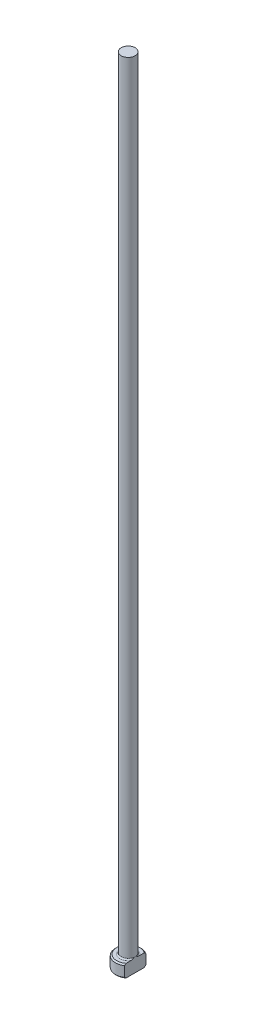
ISO-10303-21;
HEADER;
FILE_DESCRIPTION(('STEP AP214'),'2;1');
FILE_NAME('part.step','',(''),(''),'','','');
FILE_SCHEMA(('AUTOMOTIVE_DESIGN { 1 0 10303 214 1 1 1 1 }'));
ENDSEC;
DATA;
#1=APPLICATION_CONTEXT('core data for automotive mechanical design processes');
#2=APPLICATION_PROTOCOL_DEFINITION('international standard','automotive_design',2000,#1);
#3=PRODUCT_CONTEXT('',#1,'mechanical');
#4=PRODUCT('Part','Part','',(#3));
#5=PRODUCT_RELATED_PRODUCT_CATEGORY('part','',(#4));
#6=PRODUCT_DEFINITION_FORMATION('','',#4);
#7=PRODUCT_DEFINITION_CONTEXT('part definition',#1,'design');
#8=PRODUCT_DEFINITION('design','',#6,#7);
#9=PRODUCT_DEFINITION_SHAPE('','',#8);
#10=(LENGTH_UNIT() NAMED_UNIT(*) SI_UNIT(.MILLI.,.METRE.));
#11=(NAMED_UNIT(*) PLANE_ANGLE_UNIT() SI_UNIT($,.RADIAN.));
#12=(NAMED_UNIT(*) SI_UNIT($,.STERADIAN.) SOLID_ANGLE_UNIT());
#13=UNCERTAINTY_MEASURE_WITH_UNIT(LENGTH_MEASURE(1.E-05),#10,'distance_accuracy_value','');
#14=(GEOMETRIC_REPRESENTATION_CONTEXT(3) GLOBAL_UNCERTAINTY_ASSIGNED_CONTEXT((#13)) GLOBAL_UNIT_ASSIGNED_CONTEXT((#10,
#11,#12)) REPRESENTATION_CONTEXT('',''));
#15=CARTESIAN_POINT('',(0.,0.,0.));
#16=DIRECTION('',(0.,0.,1.));
#17=DIRECTION('',(1.,0.,0.));
#18=AXIS2_PLACEMENT_3D('',#15,#16,#17);
#19=CARTESIAN_POINT('',(0.,0.,0.));
#20=DIRECTION('',(0.,-1.,0.));
#21=DIRECTION('',(0.,0.,-1.));
#22=AXIS2_PLACEMENT_3D('',#19,#20,#21);
#23=PLANE('',#22);
#24=CARTESIAN_POINT('',(0.,0.,0.));
#25=DIRECTION('',(0.,-1.,0.));
#26=DIRECTION('',(0.,0.,-1.));
#27=AXIS2_PLACEMENT_3D('',#24,#25,#26);
#28=CIRCLE('',#27,1.8);
#29=CARTESIAN_POINT('',(1.09999999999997,0.,1.42478068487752));
#30=VERTEX_POINT('',#29);
#31=CARTESIAN_POINT('',(1.09999999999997,0.,-1.42478068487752));
#32=VERTEX_POINT('',#31);
#33=EDGE_CURVE('E98',#30,#32,#28,.T.);
#34=ORIENTED_EDGE('',*,*,#33,.T.);
#35=DIRECTION('',(0.,0.,1.));
#36=VECTOR('',#35,1.);
#37=CARTESIAN_POINT('',(1.09999999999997,0.,-1.67032930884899));
#38=LINE('',#37,#36);
#39=EDGE_CURVE('E83',#32,#30,#38,.T.);
#40=ORIENTED_EDGE('',*,*,#39,.T.);
#41=EDGE_LOOP('',(#34,#40));
#42=FACE_BOUND('',#41,.T.);
#43=ADVANCED_FACE('F32',(#42),#23,.T.);
#44=CARTESIAN_POINT('',(0.,259.958771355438,0.));
#45=DIRECTION('',(0.,1.,0.));
#46=DIRECTION('',(0.,0.,1.));
#47=AXIS2_PLACEMENT_3D('',#44,#45,#46);
#48=CYLINDRICAL_SURFACE('',#47,1.99999999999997);
#49=CARTESIAN_POINT('',(0.,1.79999999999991,0.));
#50=DIRECTION('',(0.,1.,0.));
#51=DIRECTION('',(0.,0.,1.));
#52=AXIS2_PLACEMENT_3D('',#49,#50,#51);
#53=CIRCLE('',#52,1.99999999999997);
#54=CARTESIAN_POINT('',(1.09999999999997,1.79999999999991,1.67032930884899));
#55=VERTEX_POINT('',#54);
#56=CARTESIAN_POINT('',(1.09999999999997,1.79999999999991,-1.67032930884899));
#57=VERTEX_POINT('',#56);
#58=EDGE_CURVE('E104',#55,#57,#53,.F.);
#59=ORIENTED_EDGE('',*,*,#58,.T.);
#60=DIRECTION('',(0.,-1.,0.));
#61=VECTOR('',#60,1.);
#62=CARTESIAN_POINT('',(1.09999999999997,125.,-1.67032930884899));
#63=LINE('',#62,#61);
#64=CARTESIAN_POINT('',(1.09999999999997,0.199999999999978,-1.67032930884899));
#65=VERTEX_POINT('',#64);
#66=EDGE_CURVE('E183',#57,#65,#63,.T.);
#67=ORIENTED_EDGE('',*,*,#66,.T.);
#68=CARTESIAN_POINT('',(0.,0.199999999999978,0.));
#69=DIRECTION('',(0.,-1.,0.));
#70=DIRECTION('',(0.,0.,-1.));
#71=AXIS2_PLACEMENT_3D('',#68,#69,#70);
#72=CIRCLE('',#71,1.99999999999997);
#73=CARTESIAN_POINT('',(1.09999999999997,0.199999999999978,1.67032930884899));
#74=VERTEX_POINT('',#73);
#75=EDGE_CURVE('E100',#65,#74,#72,.F.);
#76=ORIENTED_EDGE('',*,*,#75,.T.);
#77=DIRECTION('',(0.,-1.,0.));
#78=VECTOR('',#77,1.);
#79=CARTESIAN_POINT('',(1.09999999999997,125.,1.67032930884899));
#80=LINE('',#79,#78);
#81=EDGE_CURVE('E93',#55,#74,#80,.T.);
#82=ORIENTED_EDGE('',*,*,#81,.F.);
#83=EDGE_LOOP('',(#59,#67,#76,#82));
#84=FACE_BOUND('',#83,.T.);
#85=ADVANCED_FACE('F158',(#84),#48,.T.);
#86=CARTESIAN_POINT('',(-1.99999999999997,2.,0.));
#87=DIRECTION('',(0.,1.,0.));
#88=DIRECTION('',(0.,0.,1.));
#89=AXIS2_PLACEMENT_3D('',#86,#87,#88);
#90=PLANE('',#89);
#91=CARTESIAN_POINT('',(0.,2.,0.));
#92=DIRECTION('',(0.,1.,0.));
#93=DIRECTION('',(0.,0.,1.));
#94=AXIS2_PLACEMENT_3D('',#91,#92,#93);
#95=CIRCLE('',#94,1.79999999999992);
#96=CARTESIAN_POINT('',(1.09999999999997,2.,-1.42478068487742));
#97=VERTEX_POINT('',#96);
#98=CARTESIAN_POINT('',(1.09999999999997,2.,1.42478068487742));
#99=VERTEX_POINT('',#98);
#100=EDGE_CURVE('E178',#97,#99,#95,.T.);
#101=ORIENTED_EDGE('',*,*,#100,.T.);
#102=DIRECTION('',(0.,0.,-1.));
#103=VECTOR('',#102,1.);
#104=CARTESIAN_POINT('',(1.09999999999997,2.,0.));
#105=LINE('',#104,#103);
#106=CARTESIAN_POINT('',(1.09999999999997,1.99999999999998,0.692820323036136));
#107=VERTEX_POINT('',#106);
#108=EDGE_CURVE('E57',#99,#107,#105,.T.);
#109=ORIENTED_EDGE('',*,*,#108,.T.);
#110=CARTESIAN_POINT('',(0.,2.,0.));
#111=DIRECTION('',(0.,1.,0.));
#112=DIRECTION('',(0.,0.,1.));
#113=AXIS2_PLACEMENT_3D('',#110,#111,#112);
#114=CIRCLE('',#113,1.29999999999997);
#115=CARTESIAN_POINT('',(1.09999999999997,1.99999999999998,-0.692820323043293));
#116=VERTEX_POINT('',#115);
#117=EDGE_CURVE('E107',#107,#116,#114,.F.);
#118=ORIENTED_EDGE('',*,*,#117,.T.);
#119=EDGE_CURVE('E136',#116,#97,#105,.T.);
#120=ORIENTED_EDGE('',*,*,#119,.T.);
#121=EDGE_LOOP('',(#101,#109,#118,#120));
#122=FACE_BOUND('',#121,.T.);
#123=ADVANCED_FACE('F147',(#122),#90,.T.);
#124=CARTESIAN_POINT('',(0.,2.,0.));
#125=DIRECTION('',(0.,-1.,0.));
#126=DIRECTION('',(0.,0.,-1.));
#127=AXIS2_PLACEMENT_3D('',#124,#125,#126);
#128=CONICAL_SURFACE('',#127,1.79999999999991,0.785398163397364);
#129=ORIENTED_EDGE('',*,*,#58,.F.);
#130=CARTESIAN_POINT('',(1.09999999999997,-0.0394609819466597,3.67851337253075));
#131=CARTESIAN_POINT('',(1.09999999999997,0.0938871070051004,3.53927086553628));
#132=CARTESIAN_POINT('',(1.09999999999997,0.226969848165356,3.39976850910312));
#133=CARTESIAN_POINT('',(1.09999999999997,0.492235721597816,3.11984283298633));
#134=CARTESIAN_POINT('',(1.09999999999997,0.62441861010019,2.97941928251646));
#135=CARTESIAN_POINT('',(1.09999999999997,0.887405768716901,2.69736523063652));
#136=CARTESIAN_POINT('',(1.09999999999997,1.01821044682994,2.55573511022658));
#137=CARTESIAN_POINT('',(1.09999999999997,1.27771059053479,2.27057337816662));
#138=CARTESIAN_POINT('',(1.09999999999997,1.40640632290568,2.12704201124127));
#139=CARTESIAN_POINT('',(1.09999999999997,1.59274008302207,1.91391242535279));
#140=CARTESIAN_POINT('',(1.09999999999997,1.65179690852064,1.84555665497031));
#141=CARTESIAN_POINT('',(1.09999999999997,1.76883123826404,1.70791335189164));
#142=CARTESIAN_POINT('',(1.09999999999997,1.82680864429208,1.63862573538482));
#143=CARTESIAN_POINT('',(1.09999999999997,1.94139081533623,1.49868129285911));
#144=CARTESIAN_POINT('',(1.09999999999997,1.99799249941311,1.42802193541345));
#145=CARTESIAN_POINT('',(1.09999999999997,2.10905321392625,1.28504453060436));
#146=CARTESIAN_POINT('',(1.09999999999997,2.16351265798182,1.21272680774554));
#147=CARTESIAN_POINT('',(1.09999999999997,2.25351962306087,1.08760351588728));
#148=CARTESIAN_POINT('',(1.09999999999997,2.28987864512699,1.03538457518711));
#149=CARTESIAN_POINT('',(1.09999999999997,2.3604146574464,0.929499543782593));
#150=CARTESIAN_POINT('',(1.09999999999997,2.39459216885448,0.875833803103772));
#151=CARTESIAN_POINT('',(1.09999999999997,2.45984644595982,0.76675784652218));
#152=CARTESIAN_POINT('',(1.09999999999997,2.49092891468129,0.711351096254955));
#153=CARTESIAN_POINT('',(1.09999999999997,2.54873716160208,0.598347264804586));
#154=CARTESIAN_POINT('',(1.09999999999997,2.57546692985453,0.54075224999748));
#155=CARTESIAN_POINT('',(1.09999999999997,2.62531671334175,0.416467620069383));
#156=CARTESIAN_POINT('',(1.09999999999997,2.64771917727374,0.349473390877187));
#157=CARTESIAN_POINT('',(1.09999999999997,2.67308404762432,0.247046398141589));
#158=CARTESIAN_POINT('',(1.09999999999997,2.68016204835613,0.212626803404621));
#159=CARTESIAN_POINT('',(1.09999999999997,2.69123178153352,0.143302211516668));
#160=CARTESIAN_POINT('',(1.09999999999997,2.69522514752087,0.108397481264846));
#161=CARTESIAN_POINT('',(1.09999999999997,2.69990666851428,0.0380394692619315));
#162=CARTESIAN_POINT('',(1.09999999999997,2.70056409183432,0.00258409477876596));
#163=CARTESIAN_POINT('',(1.09999999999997,2.69845711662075,-0.0682167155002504));
#164=CARTESIAN_POINT('',(1.09999999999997,2.69569269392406,-0.103562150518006));
#165=CARTESIAN_POINT('',(1.09999999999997,2.68246916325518,-0.209100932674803));
#166=CARTESIAN_POINT('',(1.09999999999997,2.66707429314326,-0.278705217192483));
#167=CARTESIAN_POINT('',(1.09999999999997,2.63112909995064,-0.398409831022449));
#168=CARTESIAN_POINT('',(1.09999999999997,2.61268926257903,-0.449196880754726));
#169=CARTESIAN_POINT('',(1.09999999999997,2.57144771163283,-0.54899856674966));
#170=CARTESIAN_POINT('',(1.09999999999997,2.54864260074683,-0.598011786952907));
#171=CARTESIAN_POINT('',(1.09999999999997,2.499708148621,-0.694626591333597));
#172=CARTESIAN_POINT('',(1.09999999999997,2.47356275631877,-0.742219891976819));
#173=CARTESIAN_POINT('',(1.09999999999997,2.41890398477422,-0.83598679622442));
#174=CARTESIAN_POINT('',(1.09999999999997,2.39039158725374,-0.882160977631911));
#175=CARTESIAN_POINT('',(1.09999999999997,2.32625511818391,-0.981643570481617));
#176=CARTESIAN_POINT('',(1.09999999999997,2.29028006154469,-1.03472421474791));
#177=CARTESIAN_POINT('',(1.09999999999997,2.21653305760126,-1.1396274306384));
#178=CARTESIAN_POINT('',(1.09999999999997,2.17876074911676,-1.1914497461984));
#179=CARTESIAN_POINT('',(1.09999999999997,2.06341857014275,-1.34551007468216));
#180=CARTESIAN_POINT('',(1.09999999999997,1.98387469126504,-1.44626517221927));
#181=CARTESIAN_POINT('',(1.09999999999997,1.82152847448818,-1.64549240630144));
#182=CARTESIAN_POINT('',(1.09999999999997,1.7387185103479,-1.74395822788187));
#183=CARTESIAN_POINT('',(1.09999999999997,1.57115072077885,-1.93914128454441));
#184=CARTESIAN_POINT('',(1.09999999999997,1.48639373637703,-2.0358592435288));
#185=CARTESIAN_POINT('',(1.09999999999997,1.3154590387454,-2.22820182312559));
#186=CARTESIAN_POINT('',(1.09999999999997,1.2292799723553,-2.32382523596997));
#187=CARTESIAN_POINT('',(1.09999999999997,1.0559632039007,-2.51421569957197));
#188=CARTESIAN_POINT('',(1.09999999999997,0.968825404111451,-2.60898266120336));
#189=CARTESIAN_POINT('',(1.09999999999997,0.706597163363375,-2.89210208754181));
#190=CARTESIAN_POINT('',(1.09999999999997,0.530482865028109,-3.07950542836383));
#191=CARTESIAN_POINT('',(1.09999999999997,0.288219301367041,-3.33512571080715));
#192=CARTESIAN_POINT('',(1.09999999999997,0.222748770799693,-3.40399021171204));
#193=CARTESIAN_POINT('',(1.09999999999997,0.091724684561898,-3.54143252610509));
#194=CARTESIAN_POINT('',(1.09999999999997,0.0261714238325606,-3.61001062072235));
#195=CARTESIAN_POINT('',(1.09999999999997,-0.0394609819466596,-3.67851337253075));
#196=B_SPLINE_CURVE_WITH_KNOTS('',3,(#130,#131,#132,#133,#134,#135,#136,#137,#138,#139,#140,
#141,#142,#143,#144,#145,#146,#147,#148,#149,#150,#151,#152,#153,#154,#155,#156,#157,#158,#159,
#160,#161,#162,#163,#164,#165,#166,#167,#168,#169,#170,#171,#172,#173,#174,#175,#176,#177,#178,
#179,#180,#181,#182,#183,#184,#185,#186,#187,#188,#189,#190,#191,#192,#193,#194,#195),
.UNSPECIFIED.,.F.,.F.,(4,2,2,2,2,2,2,2,2,2,2,2,2,2,2,2,2,2,2,2,2,2,2,2,2,2,2,2,2,2,2,2,4),(0.,
0.578393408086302,1.1569377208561,1.73530565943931,2.31359986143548,2.5845938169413,
2.8556123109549,3.12719032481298,3.39871564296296,3.58956709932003,3.78037278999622,
3.97082012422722,4.16109188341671,4.37223430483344,4.47753596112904,4.58278181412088,
4.68899548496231,4.79520990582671,5.00790932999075,5.16979123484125,5.33179964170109,
5.49461809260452,5.65736934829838,5.84968611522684,6.0420416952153,6.42702818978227,
6.81297408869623,7.19875629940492,7.58492959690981,7.9711426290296,8.7426312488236,
9.02768991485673,9.31229787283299),.UNSPECIFIED.);
#197=EDGE_CURVE('E135',#55,#99,#196,.T.);
#198=ORIENTED_EDGE('',*,*,#197,.T.);
#199=ORIENTED_EDGE('',*,*,#100,.F.);
#200=EDGE_CURVE('E127',#97,#57,#196,.T.);
#201=ORIENTED_EDGE('',*,*,#200,.T.);
#202=EDGE_LOOP('',(#129,#198,#199,#201));
#203=FACE_BOUND('',#202,.T.);
#204=ADVANCED_FACE('F143',(#203),#128,.T.);
#205=CARTESIAN_POINT('',(0.,0.199999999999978,0.));
#206=DIRECTION('',(0.,1.,0.));
#207=DIRECTION('',(0.,0.,1.));
#208=AXIS2_PLACEMENT_3D('',#205,#206,#207);
#209=CONICAL_SURFACE('',#208,1.99999999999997,0.785398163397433);
#210=ORIENTED_EDGE('',*,*,#75,.F.);
#211=CARTESIAN_POINT('',(1.09999999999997,2.03946098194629,-3.67851337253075));
#212=CARTESIAN_POINT('',(1.09999999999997,1.90611289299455,-3.53927086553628));
#213=CARTESIAN_POINT('',(1.09999999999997,1.77303015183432,-3.39976850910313));
#214=CARTESIAN_POINT('',(1.09999999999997,1.50776427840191,-3.11984283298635));
#215=CARTESIAN_POINT('',(1.09999999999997,1.37558138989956,-2.97941928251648));
#216=CARTESIAN_POINT('',(1.09999999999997,1.11259423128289,-2.69736523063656));
#217=CARTESIAN_POINT('',(1.09999999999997,0.981789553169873,-2.55573511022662));
#218=CARTESIAN_POINT('',(1.09999999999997,0.722289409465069,-2.27057337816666));
#219=CARTESIAN_POINT('',(1.09999999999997,0.593593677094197,-2.12704201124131));
#220=CARTESIAN_POINT('',(1.09999999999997,0.407259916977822,-1.91391242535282));
#221=CARTESIAN_POINT('',(1.09999999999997,0.348203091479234,-1.84555665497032));
#222=CARTESIAN_POINT('',(1.09999999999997,0.231168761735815,-1.7079133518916));
#223=CARTESIAN_POINT('',(1.09999999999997,0.173191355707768,-1.63862573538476));
#224=CARTESIAN_POINT('',(1.09999999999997,0.0586091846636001,-1.49868129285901));
#225=CARTESIAN_POINT('',(1.09999999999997,0.00200750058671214,-1.42802193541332));
#226=CARTESIAN_POINT('',(1.09999999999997,-0.109053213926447,-1.28504453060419));
#227=CARTESIAN_POINT('',(1.09999999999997,-0.16351265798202,-1.21272680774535));
#228=CARTESIAN_POINT('',(1.09999999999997,-0.253519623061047,-1.08760351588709));
#229=CARTESIAN_POINT('',(1.09999999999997,-0.289878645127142,-1.03538457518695));
#230=CARTESIAN_POINT('',(1.09999999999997,-0.3604146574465,-0.929499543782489));
#231=CARTESIAN_POINT('',(1.09999999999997,-0.394592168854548,-0.875833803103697));
#232=CARTESIAN_POINT('',(1.09999999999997,-0.459846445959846,-0.766757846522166));
#233=CARTESIAN_POINT('',(1.09999999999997,-0.490928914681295,-0.711351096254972));
#234=CARTESIAN_POINT('',(1.09999999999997,-0.548737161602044,-0.598347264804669));
#235=CARTESIAN_POINT('',(1.09999999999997,-0.575466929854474,-0.540752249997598));
#236=CARTESIAN_POINT('',(1.09999999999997,-0.625316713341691,-0.416467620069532));
#237=CARTESIAN_POINT('',(1.09999999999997,-0.647719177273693,-0.349473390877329));
#238=CARTESIAN_POINT('',(1.09999999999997,-0.67308404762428,-0.247046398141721));
#239=CARTESIAN_POINT('',(1.09999999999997,-0.680162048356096,-0.21262680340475));
#240=CARTESIAN_POINT('',(1.09999999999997,-0.691231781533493,-0.14330221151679));
#241=CARTESIAN_POINT('',(1.09999999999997,-0.695225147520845,-0.108397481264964));
#242=CARTESIAN_POINT('',(1.09999999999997,-0.699906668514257,-0.0380394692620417));
#243=CARTESIAN_POINT('',(1.09999999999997,-0.700564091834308,-0.00258409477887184));
#244=CARTESIAN_POINT('',(1.09999999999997,-0.698457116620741,0.0682167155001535));
#245=CARTESIAN_POINT('',(1.09999999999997,-0.695692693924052,0.103562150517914));
#246=CARTESIAN_POINT('',(1.09999999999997,-0.682469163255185,0.209100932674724));
#247=CARTESIAN_POINT('',(1.09999999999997,-0.667074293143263,0.278705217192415));
#248=CARTESIAN_POINT('',(1.09999999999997,-0.631129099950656,0.398409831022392));
#249=CARTESIAN_POINT('',(1.09999999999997,-0.612689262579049,0.449196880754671));
#250=CARTESIAN_POINT('',(1.09999999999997,-0.571447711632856,0.548998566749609));
#251=CARTESIAN_POINT('',(1.09999999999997,-0.548642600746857,0.598011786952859));
#252=CARTESIAN_POINT('',(1.09999999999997,-0.499708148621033,0.694626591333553));
#253=CARTESIAN_POINT('',(1.09999999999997,-0.47356275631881,0.742219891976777));
#254=CARTESIAN_POINT('',(1.09999999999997,-0.418903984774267,0.835986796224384));
#255=CARTESIAN_POINT('',(1.09999999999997,-0.390391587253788,0.882160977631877));
#256=CARTESIAN_POINT('',(1.09999999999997,-0.32625511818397,0.981643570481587));
#257=CARTESIAN_POINT('',(1.09999999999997,-0.290280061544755,1.03472421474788));
#258=CARTESIAN_POINT('',(1.09999999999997,-0.216533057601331,1.13962743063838));
#259=CARTESIAN_POINT('',(1.09999999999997,-0.178760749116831,1.19144974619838));
#260=CARTESIAN_POINT('',(1.09999999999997,-0.0634185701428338,1.34551007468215));
#261=CARTESIAN_POINT('',(1.09999999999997,0.0161253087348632,1.44626517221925));
#262=CARTESIAN_POINT('',(1.09999999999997,0.178471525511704,1.64549240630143));
#263=CARTESIAN_POINT('',(1.09999999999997,0.261281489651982,1.74395822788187));
#264=CARTESIAN_POINT('',(1.09999999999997,0.428849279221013,1.93914128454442));
#265=CARTESIAN_POINT('',(1.09999999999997,0.513606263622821,2.0358592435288));
#266=CARTESIAN_POINT('',(1.09999999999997,0.684540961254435,2.22820182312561));
#267=CARTESIAN_POINT('',(1.09999999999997,0.770720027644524,2.32382523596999));
#268=CARTESIAN_POINT('',(1.09999999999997,0.944036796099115,2.514215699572));
#269=CARTESIAN_POINT('',(1.09999999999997,1.03117459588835,2.60898266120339));
#270=CARTESIAN_POINT('',(1.09999999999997,1.2934028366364,2.89210208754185));
#271=CARTESIAN_POINT('',(1.09999999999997,1.46951713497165,3.07950542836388));
#272=CARTESIAN_POINT('',(1.09999999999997,1.71178069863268,3.33512571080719));
#273=CARTESIAN_POINT('',(1.09999999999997,1.77725122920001,3.40399021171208));
#274=CARTESIAN_POINT('',(1.09999999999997,1.90827531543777,3.5414325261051));
#275=CARTESIAN_POINT('',(1.09999999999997,1.97382857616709,3.61001062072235));
#276=CARTESIAN_POINT('',(1.09999999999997,2.03946098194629,3.67851337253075));
#277=B_SPLINE_CURVE_WITH_KNOTS('',3,(#211,#212,#213,#214,#215,#216,#217,#218,#219,#220,#221,
#222,#223,#224,#225,#226,#227,#228,#229,#230,#231,#232,#233,#234,#235,#236,#237,#238,#239,#240,
#241,#242,#243,#244,#245,#246,#247,#248,#249,#250,#251,#252,#253,#254,#255,#256,#257,#258,#259,
#260,#261,#262,#263,#264,#265,#266,#267,#268,#269,#270,#271,#272,#273,#274,#275,#276),
.UNSPECIFIED.,.F.,.F.,(4,2,2,2,2,2,2,2,2,2,2,2,2,2,2,2,2,2,2,2,2,2,2,2,2,2,2,2,2,2,2,2,4),(0.,
0.57839340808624,1.15693772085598,1.73530565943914,2.31359986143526,2.58459381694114,
2.85561231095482,3.12719032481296,3.39871564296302,3.58956709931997,3.78037278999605,
3.97082012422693,4.1610918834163,4.37223430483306,4.47753596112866,4.58278181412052,
4.68899548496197,4.79520990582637,5.00790932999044,5.16979123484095,5.33179964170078,
5.49461809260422,5.65736934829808,5.84968611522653,6.04204169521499,6.42702818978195,
6.8129740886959,7.19875629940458,7.58492959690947,7.97114262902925,8.74263124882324,
9.0276899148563,9.3122978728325),.UNSPECIFIED.);
#278=EDGE_CURVE('E86',#65,#32,#277,.T.);
#279=ORIENTED_EDGE('',*,*,#278,.T.);
#280=ORIENTED_EDGE('',*,*,#33,.F.);
#281=EDGE_CURVE('E89',#30,#74,#277,.T.);
#282=ORIENTED_EDGE('',*,*,#281,.T.);
#283=EDGE_LOOP('',(#210,#279,#280,#282));
#284=FACE_BOUND('',#283,.T.);
#285=ADVANCED_FACE('F97',(#284),#209,.T.);
#286=CARTESIAN_POINT('',(0.,2.19999999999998,0.));
#287=DIRECTION('',(0.,1.,0.));
#288=DIRECTION('',(0.,0.,1.));
#289=AXIS2_PLACEMENT_3D('',#286,#287,#288);
#290=TOROIDAL_SURFACE('',#289,1.29999999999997,0.2);
#291=CARTESIAN_POINT('',(1.09999999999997,2.19999999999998,0.));
#292=CARTESIAN_POINT('',(1.09999999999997,2.20000051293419,3.6073967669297E-11));
#293=CARTESIAN_POINT('',(1.09999999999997,2.20000102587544,-9.99111383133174E-08));
#294=CARTESIAN_POINT('',(1.09999999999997,2.20000201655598,-4.21307805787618E-07));
#295=CARTESIAN_POINT('',(1.09999999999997,2.20000249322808,-6.45471450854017E-07));
#296=CARTESIAN_POINT('',(1.09999999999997,2.20000344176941,-1.18549609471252E-06));
#297=CARTESIAN_POINT('',(1.09999999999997,2.20000391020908,-1.50725452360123E-06));
#298=CARTESIAN_POINT('',(1.09999999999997,2.20000479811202,-2.20431303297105E-06));
#299=CARTESIAN_POINT('',(1.09999999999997,2.20000521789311,-2.5792253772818E-06));
#300=CARTESIAN_POINT('',(1.09999999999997,2.2000066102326,-3.91337800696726E-06));
#301=CARTESIAN_POINT('',(1.09999999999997,2.20000751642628,-4.94273423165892E-06));
#302=CARTESIAN_POINT('',(1.09999999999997,2.20000914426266,-7.08045055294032E-06));
#303=CARTESIAN_POINT('',(1.09999999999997,2.20000987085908,-8.18525581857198E-06));
#304=CARTESIAN_POINT('',(1.09999999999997,2.20001256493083,-1.24548986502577E-05));
#305=CARTESIAN_POINT('',(1.09999999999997,2.20001438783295,-1.57147536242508E-05));
#306=CARTESIAN_POINT('',(1.09999999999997,2.20001740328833,-2.21764542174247E-05));
#307=CARTESIAN_POINT('',(1.09999999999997,2.20001863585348,-2.53602841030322E-05));
#308=CARTESIAN_POINT('',(1.09999999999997,2.20002381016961,-3.88057522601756E-05));
#309=CARTESIAN_POINT('',(1.09999999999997,2.20002769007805,-4.90846952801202E-05));
#310=CARTESIAN_POINT('',(1.09999999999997,2.20003398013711,-6.83950902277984E-05));
#311=CARTESIAN_POINT('',(1.09999999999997,2.2000365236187,-7.73813874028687E-05));
#312=CARTESIAN_POINT('',(1.09999999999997,2.20005650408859,-0.000142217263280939));
#313=CARTESIAN_POINT('',(1.09999999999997,2.2000817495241,-0.000195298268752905));
#314=CARTESIAN_POINT('',(1.09999999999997,2.20017599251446,-0.00040106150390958));
#315=CARTESIAN_POINT('',(1.09999999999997,2.20023918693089,-0.000555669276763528));
#316=CARTESIAN_POINT('',(1.09999999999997,2.20048725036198,-0.00115356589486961));
#317=CARTESIAN_POINT('',(1.09999999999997,2.20067820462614,-0.00159487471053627));
#318=CARTESIAN_POINT('',(1.09999999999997,2.20145114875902,-0.00338993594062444));
#319=CARTESIAN_POINT('',(1.09999999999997,2.20202628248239,-0.00474587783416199));
#320=CARTESIAN_POINT('',(1.09999999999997,2.20972642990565,-0.0228890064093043));
#321=CARTESIAN_POINT('',(1.09999999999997,2.21689763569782,-0.0396618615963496));
#322=CARTESIAN_POINT('',(1.09999999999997,2.23088776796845,-0.0726432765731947));
#323=CARTESIAN_POINT('',(1.09999999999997,2.23771010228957,-0.0888504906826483));
#324=CARTESIAN_POINT('',(1.09999999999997,2.2520105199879,-0.12316170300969));
#325=CARTESIAN_POINT('',(1.09999999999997,2.25947482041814,-0.141271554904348));
#326=CARTESIAN_POINT('',(1.09999999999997,2.27424285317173,-0.177765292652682));
#327=CARTESIAN_POINT('',(1.09999999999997,2.28154426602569,-0.196150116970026));
#328=CARTESIAN_POINT('',(1.09999999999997,2.29932484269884,-0.242089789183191));
#329=CARTESIAN_POINT('',(1.09999999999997,2.30960714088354,-0.269721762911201));
#330=CARTESIAN_POINT('',(1.09999999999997,2.32891385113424,-0.324725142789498));
#331=CARTESIAN_POINT('',(1.09999999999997,2.33796145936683,-0.352088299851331));
#332=CARTESIAN_POINT('',(1.09999999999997,2.35364474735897,-0.40369058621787));
#333=CARTESIAN_POINT('',(1.09999999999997,2.36044093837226,-0.427880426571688));
#334=CARTESIAN_POINT('',(1.09999999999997,2.37278398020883,-0.47674569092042));
#335=CARTESIAN_POINT('',(1.09999999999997,2.37832261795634,-0.501423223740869));
#336=CARTESIAN_POINT('',(1.09999999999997,2.38801040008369,-0.552403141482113));
#337=CARTESIAN_POINT('',(1.09999999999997,2.39207120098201,-0.578722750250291));
#338=CARTESIAN_POINT('',(1.09999999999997,2.39789224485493,-0.631611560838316));
#339=CARTESIAN_POINT('',(1.09999999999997,2.39965448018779,-0.658180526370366));
#340=CARTESIAN_POINT('',(1.09999999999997,2.40018565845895,-0.705278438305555));
#341=CARTESIAN_POINT('',(1.09999999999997,2.39954710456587,-0.725798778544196));
#342=CARTESIAN_POINT('',(1.09999999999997,2.39616992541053,-0.766506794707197));
#343=CARTESIAN_POINT('',(1.09999999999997,2.39344923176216,-0.786695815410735));
#344=CARTESIAN_POINT('',(1.09999999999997,2.38541819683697,-0.826869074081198));
#345=CARTESIAN_POINT('',(1.09999999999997,2.38007173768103,-0.846846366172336));
#346=CARTESIAN_POINT('',(1.09999999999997,2.36615936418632,-0.885705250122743));
#347=CARTESIAN_POINT('',(1.09999999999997,2.35759666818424,-0.904587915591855));
#348=CARTESIAN_POINT('',(1.09999999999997,2.3413093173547,-0.932102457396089));
#349=CARTESIAN_POINT('',(1.09999999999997,2.33493263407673,-0.94153212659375));
#350=CARTESIAN_POINT('',(1.09999999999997,2.32089802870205,-0.959389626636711));
#351=CARTESIAN_POINT('',(1.09999999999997,2.31324176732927,-0.967818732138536));
#352=CARTESIAN_POINT('',(1.09999999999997,2.29794985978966,-0.982021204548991));
#353=CARTESIAN_POINT('',(1.09999999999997,2.2905098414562,-0.988003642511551));
#354=CARTESIAN_POINT('',(1.09999999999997,2.27474667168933,-0.998671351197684));
#355=CARTESIAN_POINT('',(1.09999999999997,2.26642452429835,-1.00335807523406));
#356=CARTESIAN_POINT('',(1.09999999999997,2.25045003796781,-1.01049114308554));
#357=CARTESIAN_POINT('',(1.09999999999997,2.24290483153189,-1.01317643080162));
#358=CARTESIAN_POINT('',(1.09999999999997,2.22746947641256,-1.01724295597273));
#359=CARTESIAN_POINT('',(1.09999999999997,2.21957951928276,-1.01862490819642));
#360=CARTESIAN_POINT('',(1.09999999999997,2.20365797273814,-1.0199891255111));
#361=CARTESIAN_POINT('',(1.09999999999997,2.19562607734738,-1.01996786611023));
#362=CARTESIAN_POINT('',(1.09999999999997,2.17969084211,-1.01851853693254));
#363=CARTESIAN_POINT('',(1.09999999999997,2.1717875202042,-1.01709027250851));
#364=CARTESIAN_POINT('',(1.09999999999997,2.15661212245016,-1.01300324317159));
#365=CARTESIAN_POINT('',(1.09999999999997,2.14932759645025,-1.01038998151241));
#366=CARTESIAN_POINT('',(1.09999999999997,2.13523656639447,-1.00410166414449));
#367=CARTESIAN_POINT('',(1.09999999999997,2.12843022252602,-1.00042625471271));
#368=CARTESIAN_POINT('',(1.09999999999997,2.11281201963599,-0.990557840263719));
#369=CARTESIAN_POINT('',(1.09999999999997,2.10426616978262,-0.983943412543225));
#370=CARTESIAN_POINT('',(1.09999999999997,2.08835473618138,-0.969418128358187));
#371=CARTESIAN_POINT('',(1.09999999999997,2.08099195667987,-0.961504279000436));
#372=CARTESIAN_POINT('',(1.09999999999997,2.06451454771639,-0.941147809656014));
#373=CARTESIAN_POINT('',(1.09999999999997,2.05600335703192,-0.928218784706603));
#374=CARTESIAN_POINT('',(1.09999999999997,2.04111601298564,-0.901229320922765));
#375=CARTESIAN_POINT('',(1.09999999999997,2.03473990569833,-0.887168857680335));
#376=CARTESIAN_POINT('',(1.09999999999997,2.0205978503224,-0.849888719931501));
#377=CARTESIAN_POINT('',(1.09999999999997,2.01422029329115,-0.826146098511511));
#378=CARTESIAN_POINT('',(1.09999999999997,2.0050305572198,-0.777766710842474));
#379=CARTESIAN_POINT('',(1.09999999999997,2.00226155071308,-0.753122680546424));
#380=CARTESIAN_POINT('',(1.09999999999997,1.99848820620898,-0.682856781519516));
#381=CARTESIAN_POINT('',(1.09999999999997,2.00093637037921,-0.637054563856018));
#382=CARTESIAN_POINT('',(1.09999999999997,2.0092928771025,-0.570140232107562));
#383=CARTESIAN_POINT('',(1.09999999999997,2.01272884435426,-0.548616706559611));
#384=CARTESIAN_POINT('',(1.09999999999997,2.02080692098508,-0.505905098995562));
#385=CARTESIAN_POINT('',(1.09999999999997,2.0254425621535,-0.484715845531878));
#386=CARTESIAN_POINT('',(1.09999999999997,2.03889892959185,-0.42948239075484));
#387=CARTESIAN_POINT('',(1.09999999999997,2.04852945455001,-0.395639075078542));
#388=CARTESIAN_POINT('',(1.09999999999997,2.06989966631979,-0.327791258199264));
#389=CARTESIAN_POINT('',(1.09999999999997,2.08168242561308,-0.293800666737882));
#390=CARTESIAN_POINT('',(1.09999999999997,2.10244380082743,-0.237493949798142));
#391=CARTESIAN_POINT('',(1.09999999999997,2.11105810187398,-0.21504099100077));
#392=CARTESIAN_POINT('',(1.09999999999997,2.12862794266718,-0.170525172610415));
#393=CARTESIAN_POINT('',(1.09999999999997,2.13757927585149,-0.14846064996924));
#394=CARTESIAN_POINT('',(1.09999999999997,2.15480867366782,-0.106697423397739));
#395=CARTESIAN_POINT('',(1.09999999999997,2.16306162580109,-0.0869881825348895));
#396=CARTESIAN_POINT('',(1.09999999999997,2.18002424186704,-0.0468908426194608));
#397=CARTESIAN_POINT('',(1.09999999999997,2.18873943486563,-0.0265049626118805));
#398=CARTESIAN_POINT('',(1.09999999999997,2.19797392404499,-0.00474531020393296));
#399=CARTESIAN_POINT('',(1.09999999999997,2.19854931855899,-0.00338881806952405));
#400=CARTESIAN_POINT('',(1.09999999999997,2.1993223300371,-0.00159362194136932));
#401=CARTESIAN_POINT('',(1.09999999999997,2.19951310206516,-0.00115273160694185));
#402=CARTESIAN_POINT('',(1.09999999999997,2.19976094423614,-0.000555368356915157));
#403=CARTESIAN_POINT('',(1.09999999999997,2.19982409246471,-0.000400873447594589));
#404=CARTESIAN_POINT('',(1.09999999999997,2.19991827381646,-0.000195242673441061));
#405=CARTESIAN_POINT('',(1.09999999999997,2.19994350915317,-0.000142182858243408));
#406=CARTESIAN_POINT('',(1.09999999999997,2.19996348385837,-7.73713511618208E-05));
#407=CARTESIAN_POINT('',(1.09999999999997,2.19996602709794,-6.83867125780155E-05));
#408=CARTESIAN_POINT('',(1.09999999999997,2.19997231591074,-4.90799325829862E-05));
#409=CARTESIAN_POINT('',(1.09999999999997,2.19997619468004,-3.88029010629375E-05));
#410=CARTESIAN_POINT('',(1.09999999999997,2.19998136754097,-2.53595805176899E-05));
#411=CARTESIAN_POINT('',(1.09999999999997,2.19998259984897,-2.21760163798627E-05));
#412=CARTESIAN_POINT('',(1.09999999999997,2.19998561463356,-1.57148108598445E-05));
#413=CARTESIAN_POINT('',(1.09999999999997,2.19998743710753,-1.24551761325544E-05));
#414=CARTESIAN_POINT('',(1.09999999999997,2.19999013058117,-8.18573740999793E-06));
#415=CARTESIAN_POINT('',(1.09999999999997,2.19999085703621,-7.08095311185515E-06));
#416=CARTESIAN_POINT('',(1.09999999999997,2.19999248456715,-4.94325032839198E-06));
#417=CARTESIAN_POINT('',(1.09999999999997,2.19999339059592,-3.9138854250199E-06));
#418=CARTESIAN_POINT('',(1.09999999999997,2.19999478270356,-2.57968679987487E-06));
#419=CARTESIAN_POINT('',(1.09999999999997,2.19999520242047,-2.2047544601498E-06));
#420=CARTESIAN_POINT('',(1.09999999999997,2.1999960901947,-1.50764450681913E-06));
#421=CARTESIAN_POINT('',(1.09999999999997,2.1999965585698,-1.18585452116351E-06));
#422=CARTESIAN_POINT('',(1.09999999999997,2.19999750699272,-6.45753424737E-07));
#423=CARTESIAN_POINT('',(1.09999999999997,2.1999979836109,-4.21546286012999E-07));
#424=CARTESIAN_POINT('',(1.09999999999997,2.19999897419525,-1.00044385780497E-07));
#425=CARTESIAN_POINT('',(1.09999999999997,2.1999994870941,-3.60719752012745E-11));
#426=CARTESIAN_POINT('',(1.09999999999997,2.19999999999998,0.));
#427=B_SPLINE_CURVE_WITH_KNOTS('',3,(#291,#292,#293,#294,#295,#296,#297,#298,#299,#300,#301,
#302,#303,#304,#305,#306,#307,#308,#309,#310,#311,#312,#313,#314,#315,#316,#317,#318,#319,#320,
#321,#322,#323,#324,#325,#326,#327,#328,#329,#330,#331,#332,#333,#334,#335,#336,#337,#338,#339,
#340,#341,#342,#343,#344,#345,#346,#347,#348,#349,#350,#351,#352,#353,#354,#355,#356,#357,#358,
#359,#360,#361,#362,#363,#364,#365,#366,#367,#368,#369,#370,#371,#372,#373,#374,#375,#376,#377,
#378,#379,#380,#381,#382,#383,#384,#385,#386,#387,#388,#389,#390,#391,#392,#393,#394,#395,#396,
#397,#398,#399,#400,#401,#402,#403,#404,#405,#406,#407,#408,#409,#410,#411,#412,#413,#414,#415,
#416,#417,#418,#419,#420,#421,#422,#423,#424,#425,#426),.UNSPECIFIED.,.T.,.F.,(4,2,2,2,2,2,2,2,
2,2,2,2,2,2,2,2,2,2,2,2,2,2,2,2,2,2,2,2,2,2,2,2,2,2,2,2,2,2,2,2,2,2,2,2,2,2,2,2,2,2,2,2,2,2,2,2,
2,2,2,2,2,2,2,2,2,2,2,4),(0.,1.53757781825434E-06,3.11015844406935E-06,4.80844102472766E-06,
6.49491820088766E-06,1.05889533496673E-05,1.4552753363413E-05,2.57199109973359E-05,
3.59516089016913E-05,6.89038245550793E-05,9.68952770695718E-05,0.000272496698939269,
0.000774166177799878,0.00221597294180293,0.00663537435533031,0.0613537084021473,
0.114108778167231,0.172870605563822,0.232213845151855,0.32064861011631,0.407082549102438,
0.482434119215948,0.558264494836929,0.638080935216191,0.717828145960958,0.779333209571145,
0.840314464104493,0.902159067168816,0.963941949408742,0.998002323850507,1.03201883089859,
1.06055188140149,1.08905279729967,1.1129756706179,1.136885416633,1.16085521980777,
1.18482833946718,1.20795004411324,1.23107945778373,1.26331905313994,1.29563397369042,
1.341811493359,1.38799000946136,1.46132993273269,1.53553947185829,1.67227413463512,
1.73765429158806,1.8026890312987,1.90816998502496,2.01605526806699,2.08819695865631,
2.15962670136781,2.22373012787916,2.29023422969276,2.2946554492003,2.29609588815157,
2.29659719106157,2.29677272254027,2.29680070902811,2.29683365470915,2.2968438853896,
2.29685505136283,2.29685901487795,2.29686310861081,2.29686479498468,2.2968664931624,
2.29686806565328,2.29686960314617),.UNSPECIFIED.);
#428=CARTESIAN_POINT('',(1.09999999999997,2.19999999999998,0.));
#429=VERTEX_POINT('',#428);
#430=EDGE_CURVE('E11',#116,#429,#427,.T.);
#431=ORIENTED_EDGE('',*,*,#430,.F.);
#432=ORIENTED_EDGE('',*,*,#117,.F.);
#433=CARTESIAN_POINT('',(1.09999999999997,2.19999999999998,0.));
#434=CARTESIAN_POINT('',(1.09999999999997,2.19999948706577,-3.60741074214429E-11));
#435=CARTESIAN_POINT('',(1.09999999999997,2.19999897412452,9.99111381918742E-08));
#436=CARTESIAN_POINT('',(1.09999999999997,2.19999798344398,4.21307805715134E-07));
#437=CARTESIAN_POINT('',(1.09999999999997,2.19999750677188,6.4547145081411E-07));
#438=CARTESIAN_POINT('',(1.09999999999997,2.19999655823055,1.18549609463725E-06));
#439=CARTESIAN_POINT('',(1.09999999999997,2.19999608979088,1.50725452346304E-06));
#440=CARTESIAN_POINT('',(1.09999999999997,2.19999520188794,2.20431303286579E-06));
#441=CARTESIAN_POINT('',(1.09999999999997,2.19999478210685,2.5792253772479E-06));
#442=CARTESIAN_POINT('',(1.09999999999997,2.19999338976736,3.91337800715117E-06));
#443=CARTESIAN_POINT('',(1.09999999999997,2.19999248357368,4.9427342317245E-06));
#444=CARTESIAN_POINT('',(1.09999999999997,2.1999908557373,7.08045055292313E-06));
#445=CARTESIAN_POINT('',(1.09999999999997,2.19999012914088,8.18525581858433E-06));
#446=CARTESIAN_POINT('',(1.09999999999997,2.19998743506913,1.2454898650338E-05));
#447=CARTESIAN_POINT('',(1.09999999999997,2.19998561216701,1.57147536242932E-05));
#448=CARTESIAN_POINT('',(1.09999999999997,2.19998259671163,2.21764542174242E-05));
#449=CARTESIAN_POINT('',(1.09999999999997,2.19998136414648,2.53602841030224E-05));
#450=CARTESIAN_POINT('',(1.09999999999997,2.19997618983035,3.88057522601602E-05));
#451=CARTESIAN_POINT('',(1.09999999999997,2.19997230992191,4.90846952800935E-05));
#452=CARTESIAN_POINT('',(1.09999999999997,2.19996601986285,6.83950902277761E-05));
#453=CARTESIAN_POINT('',(1.09999999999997,2.19996347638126,7.7381387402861E-05));
#454=CARTESIAN_POINT('',(1.09999999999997,2.19994349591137,0.000142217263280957));
#455=CARTESIAN_POINT('',(1.09999999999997,2.19991825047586,0.000195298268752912));
#456=CARTESIAN_POINT('',(1.09999999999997,2.1998240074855,0.000401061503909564));
#457=CARTESIAN_POINT('',(1.09999999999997,2.19976081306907,0.000555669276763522));
#458=CARTESIAN_POINT('',(1.09999999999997,2.19951274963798,0.00115356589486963));
#459=CARTESIAN_POINT('',(1.09999999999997,2.19932179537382,0.00159487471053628));
#460=CARTESIAN_POINT('',(1.09999999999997,2.19854885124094,0.00338993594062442));
#461=CARTESIAN_POINT('',(1.09999999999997,2.19797371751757,0.00474587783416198));
#462=CARTESIAN_POINT('',(1.09999999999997,2.19027357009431,0.0228890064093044));
#463=CARTESIAN_POINT('',(1.09999999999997,2.18310236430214,0.0396618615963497));
#464=CARTESIAN_POINT('',(1.09999999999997,2.16911223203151,0.0726432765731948));
#465=CARTESIAN_POINT('',(1.09999999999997,2.16228989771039,0.0888504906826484));
#466=CARTESIAN_POINT('',(1.09999999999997,2.14798948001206,0.12316170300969));
#467=CARTESIAN_POINT('',(1.09999999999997,2.14052517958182,0.141271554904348));
#468=CARTESIAN_POINT('',(1.09999999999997,2.12575714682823,0.177765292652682));
#469=CARTESIAN_POINT('',(1.09999999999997,2.11845573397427,0.196150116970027));
#470=CARTESIAN_POINT('',(1.09999999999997,2.10067515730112,0.242089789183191));
#471=CARTESIAN_POINT('',(1.09999999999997,2.09039285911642,0.269721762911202));
#472=CARTESIAN_POINT('',(1.09999999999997,2.07108614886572,0.324725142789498));
#473=CARTESIAN_POINT('',(1.09999999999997,2.06203854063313,0.352088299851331));
#474=CARTESIAN_POINT('',(1.09999999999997,2.04635525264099,0.40369058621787));
#475=CARTESIAN_POINT('',(1.09999999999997,2.0395590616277,0.427880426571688));
#476=CARTESIAN_POINT('',(1.09999999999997,2.02721601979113,0.47674569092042));
#477=CARTESIAN_POINT('',(1.09999999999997,2.02167738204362,0.50142322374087));
#478=CARTESIAN_POINT('',(1.09999999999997,2.01198959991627,0.552403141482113));
#479=CARTESIAN_POINT('',(1.09999999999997,2.00792879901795,0.578722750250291));
#480=CARTESIAN_POINT('',(1.09999999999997,2.00210775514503,0.631611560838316));
#481=CARTESIAN_POINT('',(1.09999999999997,2.00034551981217,0.658180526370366));
#482=CARTESIAN_POINT('',(1.09999999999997,1.99981434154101,0.705278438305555));
#483=CARTESIAN_POINT('',(1.09999999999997,2.00045289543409,0.725798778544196));
#484=CARTESIAN_POINT('',(1.09999999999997,2.00383007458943,0.766506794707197));
#485=CARTESIAN_POINT('',(1.09999999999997,2.0065507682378,0.786695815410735));
#486=CARTESIAN_POINT('',(1.09999999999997,2.01458180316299,0.826869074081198));
#487=CARTESIAN_POINT('',(1.09999999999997,2.01992826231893,0.846846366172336));
#488=CARTESIAN_POINT('',(1.09999999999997,2.03384063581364,0.885705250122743));
#489=CARTESIAN_POINT('',(1.09999999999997,2.04240333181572,0.904587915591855));
#490=CARTESIAN_POINT('',(1.09999999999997,2.05869068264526,0.932102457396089));
#491=CARTESIAN_POINT('',(1.09999999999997,2.06506736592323,0.94153212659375));
#492=CARTESIAN_POINT('',(1.09999999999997,2.07910197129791,0.959389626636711));
#493=CARTESIAN_POINT('',(1.09999999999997,2.08675823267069,0.967818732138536));
#494=CARTESIAN_POINT('',(1.09999999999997,2.1020501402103,0.982021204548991));
#495=CARTESIAN_POINT('',(1.09999999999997,2.10949015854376,0.988003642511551));
#496=CARTESIAN_POINT('',(1.09999999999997,2.12525332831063,0.998671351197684));
#497=CARTESIAN_POINT('',(1.09999999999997,2.13357547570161,1.00335807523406));
#498=CARTESIAN_POINT('',(1.09999999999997,2.14954996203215,1.01049114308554));
#499=CARTESIAN_POINT('',(1.09999999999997,2.15709516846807,1.01317643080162));
#500=CARTESIAN_POINT('',(1.09999999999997,2.1725305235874,1.01724295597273));
#501=CARTESIAN_POINT('',(1.09999999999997,2.1804204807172,1.01862490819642));
#502=CARTESIAN_POINT('',(1.09999999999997,2.19634202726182,1.0199891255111));
#503=CARTESIAN_POINT('',(1.09999999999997,2.20437392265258,1.01996786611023));
#504=CARTESIAN_POINT('',(1.09999999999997,2.22030915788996,1.01851853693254));
#505=CARTESIAN_POINT('',(1.09999999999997,2.22821247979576,1.01709027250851));
#506=CARTESIAN_POINT('',(1.09999999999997,2.2433878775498,1.01300324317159));
#507=CARTESIAN_POINT('',(1.09999999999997,2.25067240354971,1.01038998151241));
#508=CARTESIAN_POINT('',(1.09999999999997,2.26476343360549,1.00410166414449));
#509=CARTESIAN_POINT('',(1.09999999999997,2.27156977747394,1.00042625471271));
#510=CARTESIAN_POINT('',(1.09999999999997,2.28718798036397,0.990557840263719));
#511=CARTESIAN_POINT('',(1.09999999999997,2.29573383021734,0.983943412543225));
#512=CARTESIAN_POINT('',(1.09999999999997,2.31164526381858,0.969418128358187));
#513=CARTESIAN_POINT('',(1.09999999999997,2.31900804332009,0.961504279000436));
#514=CARTESIAN_POINT('',(1.09999999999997,2.33548545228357,0.941147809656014));
#515=CARTESIAN_POINT('',(1.09999999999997,2.34399664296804,0.928218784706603));
#516=CARTESIAN_POINT('',(1.09999999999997,2.35888398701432,0.901229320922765));
#517=CARTESIAN_POINT('',(1.09999999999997,2.36526009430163,0.887168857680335));
#518=CARTESIAN_POINT('',(1.09999999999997,2.37940214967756,0.849888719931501));
#519=CARTESIAN_POINT('',(1.09999999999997,2.38577970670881,0.826146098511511));
#520=CARTESIAN_POINT('',(1.09999999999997,2.39496944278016,0.777766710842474));
#521=CARTESIAN_POINT('',(1.09999999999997,2.39773844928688,0.753122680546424));
#522=CARTESIAN_POINT('',(1.09999999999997,2.40151179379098,0.682856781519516));
#523=CARTESIAN_POINT('',(1.09999999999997,2.39906362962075,0.637054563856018));
#524=CARTESIAN_POINT('',(1.09999999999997,2.39070712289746,0.570140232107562));
#525=CARTESIAN_POINT('',(1.09999999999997,2.3872711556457,0.548616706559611));
#526=CARTESIAN_POINT('',(1.09999999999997,2.37919307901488,0.505905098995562));
#527=CARTESIAN_POINT('',(1.09999999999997,2.37455743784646,0.484715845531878));
#528=CARTESIAN_POINT('',(1.09999999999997,2.36110107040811,0.42948239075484));
#529=CARTESIAN_POINT('',(1.09999999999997,2.35147054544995,0.395639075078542));
#530=CARTESIAN_POINT('',(1.09999999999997,2.33010033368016,0.327791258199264));
#531=CARTESIAN_POINT('',(1.09999999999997,2.31831757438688,0.293800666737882));
#532=CARTESIAN_POINT('',(1.09999999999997,2.29755619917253,0.237493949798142));
#533=CARTESIAN_POINT('',(1.09999999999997,2.28894189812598,0.21504099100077));
#534=CARTESIAN_POINT('',(1.09999999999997,2.27137205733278,0.170525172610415));
#535=CARTESIAN_POINT('',(1.09999999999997,2.26242072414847,0.148460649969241));
#536=CARTESIAN_POINT('',(1.09999999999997,2.24519132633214,0.106697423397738));
#537=CARTESIAN_POINT('',(1.09999999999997,2.23693837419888,0.086988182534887));
#538=CARTESIAN_POINT('',(1.09999999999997,2.21997575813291,0.0468908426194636));
#539=CARTESIAN_POINT('',(1.09999999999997,2.2112605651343,0.0265049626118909));
#540=CARTESIAN_POINT('',(1.09999999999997,2.20202607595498,0.00474531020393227));
#541=CARTESIAN_POINT('',(1.09999999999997,2.20145068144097,0.00338881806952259));
#542=CARTESIAN_POINT('',(1.09999999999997,2.20067766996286,0.0015936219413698));
#543=CARTESIAN_POINT('',(1.09999999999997,2.2004868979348,0.00115273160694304));
#544=CARTESIAN_POINT('',(1.09999999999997,2.20023905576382,0.000555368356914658));
#545=CARTESIAN_POINT('',(1.09999999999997,2.20017590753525,0.00040087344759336));
#546=CARTESIAN_POINT('',(1.09999999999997,2.2000817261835,0.000195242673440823));
#547=CARTESIAN_POINT('',(1.09999999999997,2.20005649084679,0.000142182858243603));
#548=CARTESIAN_POINT('',(1.09999999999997,2.20003651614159,7.73713511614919E-05));
#549=CARTESIAN_POINT('',(1.09999999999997,2.20003397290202,6.83867125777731E-05));
#550=CARTESIAN_POINT('',(1.09999999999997,2.20002768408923,4.90799325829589E-05));
#551=CARTESIAN_POINT('',(1.09999999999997,2.20002380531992,3.88029010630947E-05));
#552=CARTESIAN_POINT('',(1.09999999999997,2.20001863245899,2.53595805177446E-05));
#553=CARTESIAN_POINT('',(1.09999999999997,2.20001740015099,2.21760163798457E-05));
#554=CARTESIAN_POINT('',(1.09999999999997,2.2000143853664,1.57148108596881E-05));
#555=CARTESIAN_POINT('',(1.09999999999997,2.20001256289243,1.24551761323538E-05));
#556=CARTESIAN_POINT('',(1.09999999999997,2.20000986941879,8.18573740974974E-06));
#557=CARTESIAN_POINT('',(1.09999999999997,2.20000914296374,7.0809531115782E-06));
#558=CARTESIAN_POINT('',(1.09999999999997,2.20000751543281,4.94325032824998E-06));
#559=CARTESIAN_POINT('',(1.09999999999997,2.20000660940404,3.91388542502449E-06));
#560=CARTESIAN_POINT('',(1.09999999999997,2.2000052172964,2.57968680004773E-06));
#561=CARTESIAN_POINT('',(1.09999999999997,2.20000479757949,2.20475446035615E-06));
#562=CARTESIAN_POINT('',(1.09999999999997,2.20000390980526,1.50764450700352E-06));
#563=CARTESIAN_POINT('',(1.09999999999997,2.20000344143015,1.18585452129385E-06));
#564=CARTESIAN_POINT('',(1.09999999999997,2.20000249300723,6.45753424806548E-07));
#565=CARTESIAN_POINT('',(1.09999999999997,2.20000201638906,4.215462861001E-07));
#566=CARTESIAN_POINT('',(1.09999999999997,2.20000102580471,1.00044385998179E-07));
#567=CARTESIAN_POINT('',(1.09999999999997,2.20000051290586,3.60721149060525E-11));
#568=CARTESIAN_POINT('',(1.09999999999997,2.19999999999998,0.));
#569=B_SPLINE_CURVE_WITH_KNOTS('',3,(#433,#434,#435,#436,#437,#438,#439,#440,#441,#442,#443,
#444,#445,#446,#447,#448,#449,#450,#451,#452,#453,#454,#455,#456,#457,#458,#459,#460,#461,#462,
#463,#464,#465,#466,#467,#468,#469,#470,#471,#472,#473,#474,#475,#476,#477,#478,#479,#480,#481,
#482,#483,#484,#485,#486,#487,#488,#489,#490,#491,#492,#493,#494,#495,#496,#497,#498,#499,#500,
#501,#502,#503,#504,#505,#506,#507,#508,#509,#510,#511,#512,#513,#514,#515,#516,#517,#518,#519,
#520,#521,#522,#523,#524,#525,#526,#527,#528,#529,#530,#531,#532,#533,#534,#535,#536,#537,#538,
#539,#540,#541,#542,#543,#544,#545,#546,#547,#548,#549,#550,#551,#552,#553,#554,#555,#556,#557,
#558,#559,#560,#561,#562,#563,#564,#565,#566,#567,#568),.UNSPECIFIED.,.T.,.F.,(4,2,2,2,2,2,2,2,
2,2,2,2,2,2,2,2,2,2,2,2,2,2,2,2,2,2,2,2,2,2,2,2,2,2,2,2,2,2,2,2,2,2,2,2,2,2,2,2,2,2,2,2,2,2,2,2,
2,2,2,2,2,2,2,2,2,2,2,4),(0.,1.53757781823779E-06,3.11015844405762E-06,4.80844102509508E-06,
6.49491820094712E-06,1.05889533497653E-05,1.45527533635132E-05,2.57199109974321E-05,
3.59516089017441E-05,6.89038245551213E-05,9.68952770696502E-05,0.000272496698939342,
0.000774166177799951,0.002215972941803,0.00663537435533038,0.0613537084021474,0.114108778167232,
0.172870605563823,0.232213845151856,0.320648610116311,0.407082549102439,0.482434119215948,
0.558264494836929,0.638080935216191,0.717828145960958,0.779333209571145,0.840314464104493,
0.902159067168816,0.963941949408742,0.998002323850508,1.03201883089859,1.06055188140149,
1.08905279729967,1.1129756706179,1.136885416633,1.16085521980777,1.18482833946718,
1.20795004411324,1.23107945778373,1.26331905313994,1.29563397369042,1.341811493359,
1.38799000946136,1.46132993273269,1.53553947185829,1.67227413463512,1.73765429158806,
1.8026890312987,1.90816998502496,2.01605526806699,2.08819695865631,2.15962670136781,
2.22373012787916,2.29023422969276,2.2946554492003,2.29609588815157,2.29659719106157,
2.29677272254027,2.29680070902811,2.29683365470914,2.2968438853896,2.29685505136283,
2.29685901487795,2.29686310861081,2.29686479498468,2.2968664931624,2.29686806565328,
2.29686960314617),.UNSPECIFIED.);
#570=EDGE_CURVE('E46',#429,#107,#569,.T.);
#571=ORIENTED_EDGE('',*,*,#570,.F.);
#572=CARTESIAN_POINT('',(0.,2.19999999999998,0.));
#573=DIRECTION('',(0.,1.,0.));
#574=DIRECTION('',(0.,0.,1.));
#575=AXIS2_PLACEMENT_3D('',#572,#573,#574);
#576=CIRCLE('',#575,1.09999999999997);
#577=EDGE_CURVE('E103',#429,#429,#576,.T.);
#578=ORIENTED_EDGE('',*,*,#577,.F.);
#579=EDGE_LOOP('',(#431,#432,#571,#578));
#580=FACE_BOUND('',#579,.T.);
#581=ADVANCED_FACE('F34',(#580),#290,.F.);
#582=CARTESIAN_POINT('',(0.,259.958771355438,0.));
#583=DIRECTION('',(0.,1.,0.));
#584=DIRECTION('',(0.,0.,1.));
#585=AXIS2_PLACEMENT_3D('',#582,#583,#584);
#586=CYLINDRICAL_SURFACE('',#585,1.09999999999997);
#587=ORIENTED_EDGE('',*,*,#577,.T.);
#588=EDGE_LOOP('',(#587));
#589=FACE_BOUND('',#588,.T.);
#590=CARTESIAN_POINT('',(0.,125.,0.));
#591=DIRECTION('',(0.,1.,0.));
#592=DIRECTION('',(0.,0.,1.));
#593=AXIS2_PLACEMENT_3D('',#590,#591,#592);
#594=CIRCLE('',#593,1.09999999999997);
#595=CARTESIAN_POINT('',(0.,125.,1.09999999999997));
#596=VERTEX_POINT('',#595);
#597=EDGE_CURVE('E101',#596,#596,#594,.T.);
#598=ORIENTED_EDGE('',*,*,#597,.F.);
#599=EDGE_LOOP('',(#598));
#600=FACE_BOUND('',#599,.T.);
#601=ADVANCED_FACE('F155',(#589,#600),#586,.T.);
#602=CARTESIAN_POINT('',(-1.09999999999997,125.,0.));
#603=DIRECTION('',(0.,1.,0.));
#604=DIRECTION('',(0.,0.,1.));
#605=AXIS2_PLACEMENT_3D('',#602,#603,#604);
#606=PLANE('',#605);
#607=ORIENTED_EDGE('',*,*,#597,.T.);
#608=EDGE_LOOP('',(#607));
#609=FACE_BOUND('',#608,.T.);
#610=ADVANCED_FACE('F121',(#609),#606,.T.);
#611=CARTESIAN_POINT('',(1.09999999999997,125.,-1.67032930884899));
#612=DIRECTION('',(1.,0.,0.));
#613=DIRECTION('',(0.,0.,-1.));
#614=AXIS2_PLACEMENT_3D('',#611,#612,#613);
#615=PLANE('',#614);
#616=ORIENTED_EDGE('',*,*,#66,.F.);
#617=ORIENTED_EDGE('',*,*,#200,.F.);
#618=ORIENTED_EDGE('',*,*,#119,.F.);
#619=ORIENTED_EDGE('',*,*,#430,.T.);
#620=ORIENTED_EDGE('',*,*,#570,.T.);
#621=ORIENTED_EDGE('',*,*,#108,.F.);
#622=ORIENTED_EDGE('',*,*,#197,.F.);
#623=ORIENTED_EDGE('',*,*,#81,.T.);
#624=ORIENTED_EDGE('',*,*,#281,.F.);
#625=ORIENTED_EDGE('',*,*,#39,.F.);
#626=ORIENTED_EDGE('',*,*,#278,.F.);
#627=EDGE_LOOP('',(#616,#617,#618,#619,#620,#621,#622,#623,#624,#625,#626));
#628=FACE_BOUND('',#627,.T.);
#629=ADVANCED_FACE('F85',(#628),#615,.T.);
#630=CLOSED_SHELL('',(#43,#85,#123,#204,#285,#581,#601,#610,#629));
#631=MANIFOLD_SOLID_BREP('B2',#630);
#632=ADVANCED_BREP_SHAPE_REPRESENTATION('',(#18,#631),#14);
#633=SHAPE_DEFINITION_REPRESENTATION(#9,#632);
ENDSEC;
END-ISO-10303-21;
